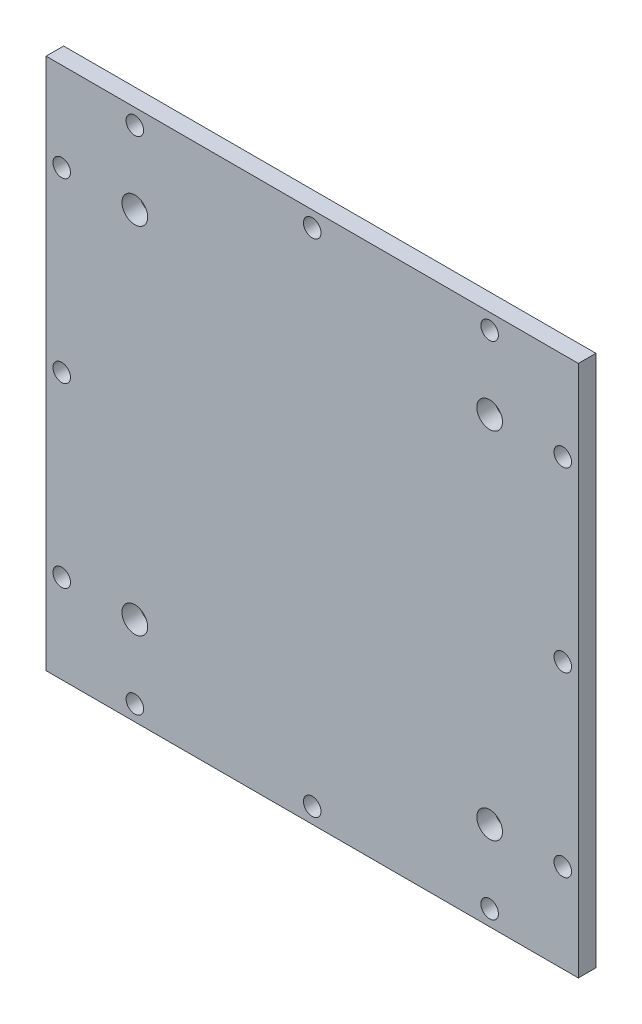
from build123d import *

# Parameters (mm, degrees)
SKETCH2_W            = 136.5
SKETCH2_H            = 136.5
BOSS_EXTRUDE1_DEPTH  = 4.5
M4_CLEARANCE_HOLE1_D = 4.5
M6_CLEARANCE_HOLE1_D = 6.6


with BuildPart() as part:
    # Sketch2 → Boss-Extrude1 (new body)
    with BuildSketch(Plane.XY):
        Rectangle(SKETCH2_W, SKETCH2_H)
    extrude(amount=BOSS_EXTRUDE1_DEPTH)

    # M4 Clearance Hole1 (through all)
    with Locations(Plane.XY.offset(4.5)):
        with Locations((-64.25, 45.5), (-64.25, 0), (-64.25, -45.5), (-45.5, 64.25), (0, 64.25), (45.5, 64.25), (64.25, -45.5), (64.25, 0), (64.25, 45.5), (45.5, -64.25), (0, -64.25), (-45.5, -64.25)):
            Hole(M4_CLEARANCE_HOLE1_D / 2)

    # M6 Clearance Hole1 (through all)
    with Locations(Plane.XY.offset(4.5)):
        with Locations((-45.5, 45.5), (-45.5, -45.5), (45.5, -45.5), (45.5, 45.5)):
            Hole(M6_CLEARANCE_HOLE1_D / 2)


solid = part.part
